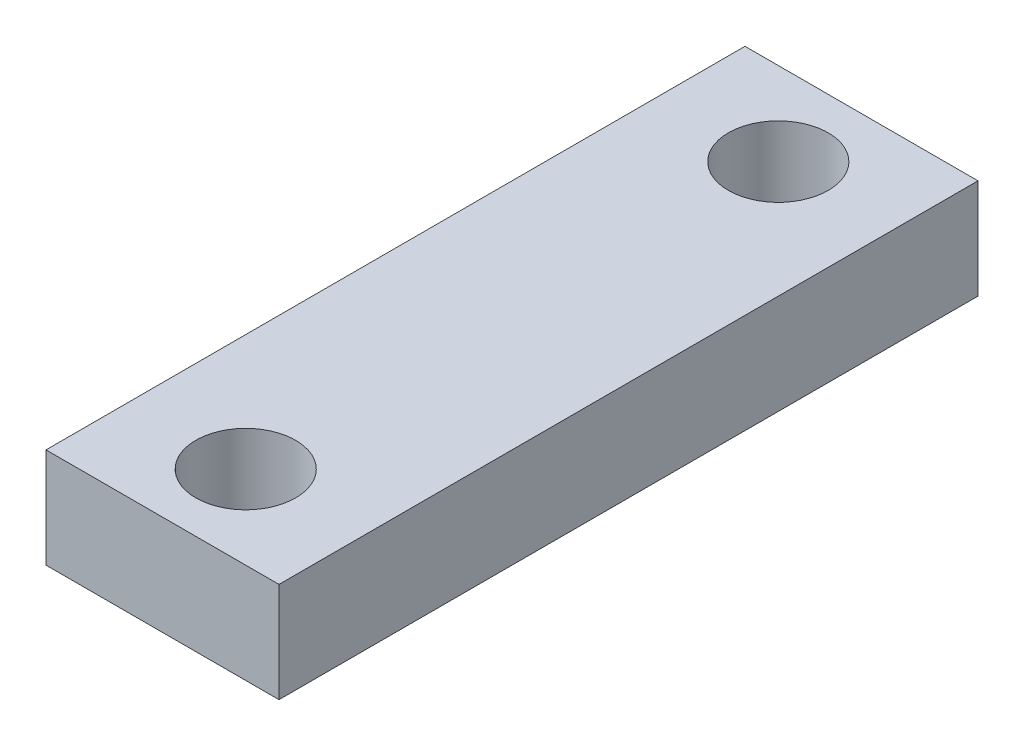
ISO-10303-21;
HEADER;
FILE_DESCRIPTION(('STEP AP214'),'2;1');
FILE_NAME('part.step','',(''),(''),'','','');
FILE_SCHEMA(('AUTOMOTIVE_DESIGN { 1 0 10303 214 1 1 1 1 }'));
ENDSEC;
DATA;
#1=APPLICATION_CONTEXT('core data for automotive mechanical design processes');
#2=APPLICATION_PROTOCOL_DEFINITION('international standard','automotive_design',2000,#1);
#3=PRODUCT_CONTEXT('',#1,'mechanical');
#4=PRODUCT('Part','Part','',(#3));
#5=PRODUCT_RELATED_PRODUCT_CATEGORY('part','',(#4));
#6=PRODUCT_DEFINITION_FORMATION('','',#4);
#7=PRODUCT_DEFINITION_CONTEXT('part definition',#1,'design');
#8=PRODUCT_DEFINITION('design','',#6,#7);
#9=PRODUCT_DEFINITION_SHAPE('','',#8);
#10=(LENGTH_UNIT() NAMED_UNIT(*) SI_UNIT(.MILLI.,.METRE.));
#11=(NAMED_UNIT(*) PLANE_ANGLE_UNIT() SI_UNIT($,.RADIAN.));
#12=(NAMED_UNIT(*) SI_UNIT($,.STERADIAN.) SOLID_ANGLE_UNIT());
#13=UNCERTAINTY_MEASURE_WITH_UNIT(LENGTH_MEASURE(1.E-05),#10,'distance_accuracy_value','');
#14=(GEOMETRIC_REPRESENTATION_CONTEXT(3) GLOBAL_UNCERTAINTY_ASSIGNED_CONTEXT((#13)) GLOBAL_UNIT_ASSIGNED_CONTEXT((#10,
#11,#12)) REPRESENTATION_CONTEXT('',''));
#15=CARTESIAN_POINT('',(0.,0.,0.));
#16=DIRECTION('',(0.,0.,1.));
#17=DIRECTION('',(1.,0.,0.));
#18=AXIS2_PLACEMENT_3D('',#15,#16,#17);
#19=CARTESIAN_POINT('',(0.,6.,0.));
#20=DIRECTION('',(0.,1.,0.));
#21=DIRECTION('',(0.,0.,1.));
#22=AXIS2_PLACEMENT_3D('',#19,#20,#21);
#23=PLANE('',#22);
#24=CARTESIAN_POINT('',(0.,6.,-16.));
#25=DIRECTION('',(0.,1.,0.));
#26=DIRECTION('',(0.,0.,1.));
#27=AXIS2_PLACEMENT_3D('',#24,#25,#26);
#28=CIRCLE('',#27,3.00000000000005);
#29=CARTESIAN_POINT('',(0.,6.,-13.));
#30=VERTEX_POINT('',#29);
#31=EDGE_CURVE('E106',#30,#30,#28,.T.);
#32=ORIENTED_EDGE('',*,*,#31,.F.);
#33=EDGE_LOOP('',(#32));
#34=FACE_BOUND('',#33,.T.);
#35=DIRECTION('',(1.,0.,0.));
#36=VECTOR('',#35,1.);
#37=CARTESIAN_POINT('',(-7.00000000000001,6.,20.9999999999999));
#38=LINE('',#37,#36);
#39=CARTESIAN_POINT('',(-7.00000000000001,6.,20.9999999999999));
#40=VERTEX_POINT('',#39);
#41=CARTESIAN_POINT('',(7.00000000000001,6.,20.9999999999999));
#42=VERTEX_POINT('',#41);
#43=EDGE_CURVE('E91',#40,#42,#38,.T.);
#44=ORIENTED_EDGE('',*,*,#43,.T.);
#45=DIRECTION('',(0.,0.,-1.));
#46=VECTOR('',#45,1.);
#47=CARTESIAN_POINT('',(7.00000000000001,6.,20.9999999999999));
#48=LINE('',#47,#46);
#49=CARTESIAN_POINT('',(7.00000000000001,6.,-20.9999999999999));
#50=VERTEX_POINT('',#49);
#51=EDGE_CURVE('E86',#42,#50,#48,.T.);
#52=ORIENTED_EDGE('',*,*,#51,.T.);
#53=DIRECTION('',(-1.,0.,0.));
#54=VECTOR('',#53,1.);
#55=CARTESIAN_POINT('',(7.00000000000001,6.,-20.9999999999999));
#56=LINE('',#55,#54);
#57=CARTESIAN_POINT('',(-7.00000000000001,6.,-20.9999999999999));
#58=VERTEX_POINT('',#57);
#59=EDGE_CURVE('E89',#50,#58,#56,.T.);
#60=ORIENTED_EDGE('',*,*,#59,.T.);
#61=DIRECTION('',(0.,0.,1.));
#62=VECTOR('',#61,1.);
#63=CARTESIAN_POINT('',(-7.00000000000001,6.,-20.9999999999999));
#64=LINE('',#63,#62);
#65=EDGE_CURVE('E56',#58,#40,#64,.T.);
#66=ORIENTED_EDGE('',*,*,#65,.T.);
#67=EDGE_LOOP('',(#44,#52,#60,#66));
#68=FACE_BOUND('',#67,.T.);
#69=CARTESIAN_POINT('',(0.,6.,16.));
#70=DIRECTION('',(0.,1.,0.));
#71=DIRECTION('',(0.,0.,1.));
#72=AXIS2_PLACEMENT_3D('',#69,#70,#71);
#73=CIRCLE('',#72,3.00000000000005);
#74=CARTESIAN_POINT('',(0.,6.,19.0000000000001));
#75=VERTEX_POINT('',#74);
#76=EDGE_CURVE('E121',#75,#75,#73,.T.);
#77=ORIENTED_EDGE('',*,*,#76,.F.);
#78=EDGE_LOOP('',(#77));
#79=FACE_BOUND('',#78,.T.);
#80=ADVANCED_FACE('F39',(#34,#68,#79),#23,.T.);
#81=CARTESIAN_POINT('',(0.,0.,0.));
#82=DIRECTION('',(0.,1.,0.));
#83=DIRECTION('',(0.,0.,1.));
#84=AXIS2_PLACEMENT_3D('',#81,#82,#83);
#85=PLANE('',#84);
#86=DIRECTION('',(1.,0.,0.));
#87=VECTOR('',#86,1.);
#88=CARTESIAN_POINT('',(-7.00000000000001,0.,20.9999999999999));
#89=LINE('',#88,#87);
#90=CARTESIAN_POINT('',(-7.00000000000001,0.,20.9999999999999));
#91=VERTEX_POINT('',#90);
#92=CARTESIAN_POINT('',(7.00000000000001,0.,20.9999999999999));
#93=VERTEX_POINT('',#92);
#94=EDGE_CURVE('E103',#91,#93,#89,.T.);
#95=ORIENTED_EDGE('',*,*,#94,.F.);
#96=DIRECTION('',(0.,0.,1.));
#97=VECTOR('',#96,1.);
#98=CARTESIAN_POINT('',(-7.00000000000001,0.,-20.9999999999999));
#99=LINE('',#98,#97);
#100=CARTESIAN_POINT('',(-7.00000000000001,0.,-20.9999999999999));
#101=VERTEX_POINT('',#100);
#102=EDGE_CURVE('E79',#101,#91,#99,.T.);
#103=ORIENTED_EDGE('',*,*,#102,.F.);
#104=DIRECTION('',(-1.,0.,0.));
#105=VECTOR('',#104,1.);
#106=CARTESIAN_POINT('',(7.00000000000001,0.,-20.9999999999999));
#107=LINE('',#106,#105);
#108=CARTESIAN_POINT('',(7.00000000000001,0.,-20.9999999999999));
#109=VERTEX_POINT('',#108);
#110=EDGE_CURVE('E73',#109,#101,#107,.T.);
#111=ORIENTED_EDGE('',*,*,#110,.F.);
#112=DIRECTION('',(0.,0.,-1.));
#113=VECTOR('',#112,1.);
#114=CARTESIAN_POINT('',(7.00000000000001,0.,20.9999999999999));
#115=LINE('',#114,#113);
#116=EDGE_CURVE('E95',#93,#109,#115,.T.);
#117=ORIENTED_EDGE('',*,*,#116,.F.);
#118=EDGE_LOOP('',(#95,#103,#111,#117));
#119=FACE_BOUND('',#118,.T.);
#120=CARTESIAN_POINT('',(0.,0.,-16.));
#121=DIRECTION('',(0.,1.,0.));
#122=DIRECTION('',(0.,0.,1.));
#123=AXIS2_PLACEMENT_3D('',#120,#121,#122);
#124=CIRCLE('',#123,3.00000000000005);
#125=CARTESIAN_POINT('',(0.,0.,-13.));
#126=VERTEX_POINT('',#125);
#127=EDGE_CURVE('E118',#126,#126,#124,.T.);
#128=ORIENTED_EDGE('',*,*,#127,.T.);
#129=EDGE_LOOP('',(#128));
#130=FACE_BOUND('',#129,.T.);
#131=CARTESIAN_POINT('',(0.,0.,16.));
#132=DIRECTION('',(0.,1.,0.));
#133=DIRECTION('',(0.,0.,1.));
#134=AXIS2_PLACEMENT_3D('',#131,#132,#133);
#135=CIRCLE('',#134,3.00000000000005);
#136=CARTESIAN_POINT('',(0.,0.,19.0000000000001));
#137=VERTEX_POINT('',#136);
#138=EDGE_CURVE('E124',#137,#137,#135,.T.);
#139=ORIENTED_EDGE('',*,*,#138,.T.);
#140=EDGE_LOOP('',(#139));
#141=FACE_BOUND('',#140,.T.);
#142=ADVANCED_FACE('F114',(#119,#130,#141),#85,.F.);
#143=CARTESIAN_POINT('',(-7.00000000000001,6.,20.9999999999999));
#144=DIRECTION('',(0.,0.,-1.));
#145=DIRECTION('',(-1.,0.,0.));
#146=AXIS2_PLACEMENT_3D('',#143,#144,#145);
#147=PLANE('',#146);
#148=ORIENTED_EDGE('',*,*,#94,.T.);
#149=DIRECTION('',(0.,-1.,0.));
#150=VECTOR('',#149,1.);
#151=CARTESIAN_POINT('',(7.00000000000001,6.,20.9999999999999));
#152=LINE('',#151,#150);
#153=EDGE_CURVE('E11',#42,#93,#152,.T.);
#154=ORIENTED_EDGE('',*,*,#153,.F.);
#155=ORIENTED_EDGE('',*,*,#43,.F.);
#156=DIRECTION('',(0.,-1.,0.));
#157=VECTOR('',#156,1.);
#158=CARTESIAN_POINT('',(-7.00000000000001,6.,20.9999999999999));
#159=LINE('',#158,#157);
#160=EDGE_CURVE('E99',#40,#91,#159,.T.);
#161=ORIENTED_EDGE('',*,*,#160,.T.);
#162=EDGE_LOOP('',(#148,#154,#155,#161));
#163=FACE_BOUND('',#162,.T.);
#164=ADVANCED_FACE('F41',(#163),#147,.F.);
#165=CARTESIAN_POINT('',(7.00000000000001,6.,20.9999999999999));
#166=DIRECTION('',(-1.,0.,0.));
#167=DIRECTION('',(0.,0.,1.));
#168=AXIS2_PLACEMENT_3D('',#165,#166,#167);
#169=PLANE('',#168);
#170=ORIENTED_EDGE('',*,*,#116,.T.);
#171=DIRECTION('',(0.,-1.,0.));
#172=VECTOR('',#171,1.);
#173=CARTESIAN_POINT('',(7.00000000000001,6.,-20.9999999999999));
#174=LINE('',#173,#172);
#175=EDGE_CURVE('E48',#50,#109,#174,.T.);
#176=ORIENTED_EDGE('',*,*,#175,.F.);
#177=ORIENTED_EDGE('',*,*,#51,.F.);
#178=ORIENTED_EDGE('',*,*,#153,.T.);
#179=EDGE_LOOP('',(#170,#176,#177,#178));
#180=FACE_BOUND('',#179,.T.);
#181=ADVANCED_FACE('F94',(#180),#169,.F.);
#182=CARTESIAN_POINT('',(7.00000000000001,6.,-20.9999999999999));
#183=DIRECTION('',(0.,0.,1.));
#184=DIRECTION('',(1.,0.,0.));
#185=AXIS2_PLACEMENT_3D('',#182,#183,#184);
#186=PLANE('',#185);
#187=ORIENTED_EDGE('',*,*,#110,.T.);
#188=DIRECTION('',(0.,-1.,0.));
#189=VECTOR('',#188,1.);
#190=CARTESIAN_POINT('',(-7.00000000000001,6.,-20.9999999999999));
#191=LINE('',#190,#189);
#192=EDGE_CURVE('E96',#58,#101,#191,.T.);
#193=ORIENTED_EDGE('',*,*,#192,.F.);
#194=ORIENTED_EDGE('',*,*,#59,.F.);
#195=ORIENTED_EDGE('',*,*,#175,.T.);
#196=EDGE_LOOP('',(#187,#193,#194,#195));
#197=FACE_BOUND('',#196,.T.);
#198=ADVANCED_FACE('F97',(#197),#186,.F.);
#199=CARTESIAN_POINT('',(-7.00000000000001,6.,-20.9999999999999));
#200=DIRECTION('',(1.,0.,0.));
#201=DIRECTION('',(0.,0.,-1.));
#202=AXIS2_PLACEMENT_3D('',#199,#200,#201);
#203=PLANE('',#202);
#204=ORIENTED_EDGE('',*,*,#102,.T.);
#205=ORIENTED_EDGE('',*,*,#160,.F.);
#206=ORIENTED_EDGE('',*,*,#65,.F.);
#207=ORIENTED_EDGE('',*,*,#192,.T.);
#208=EDGE_LOOP('',(#204,#205,#206,#207));
#209=FACE_BOUND('',#208,.T.);
#210=ADVANCED_FACE('F111',(#209),#203,.F.);
#211=CARTESIAN_POINT('',(0.,6.,-16.));
#212=DIRECTION('',(0.,-1.,0.));
#213=DIRECTION('',(0.,0.,-1.));
#214=AXIS2_PLACEMENT_3D('',#211,#212,#213);
#215=CYLINDRICAL_SURFACE('',#214,3.00000000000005);
#216=ORIENTED_EDGE('',*,*,#31,.T.);
#217=EDGE_LOOP('',(#216));
#218=FACE_BOUND('',#217,.T.);
#219=ORIENTED_EDGE('',*,*,#127,.F.);
#220=EDGE_LOOP('',(#219));
#221=FACE_BOUND('',#220,.T.);
#222=ADVANCED_FACE('F141',(#218,#221),#215,.F.);
#223=CARTESIAN_POINT('',(0.,6.,16.));
#224=DIRECTION('',(0.,-1.,0.));
#225=DIRECTION('',(0.,0.,-1.));
#226=AXIS2_PLACEMENT_3D('',#223,#224,#225);
#227=CYLINDRICAL_SURFACE('',#226,3.00000000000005);
#228=ORIENTED_EDGE('',*,*,#76,.T.);
#229=EDGE_LOOP('',(#228));
#230=FACE_BOUND('',#229,.T.);
#231=ORIENTED_EDGE('',*,*,#138,.F.);
#232=EDGE_LOOP('',(#231));
#233=FACE_BOUND('',#232,.T.);
#234=ADVANCED_FACE('F130',(#230,#233),#227,.F.);
#235=CLOSED_SHELL('',(#80,#142,#164,#181,#198,#210,#222,#234));
#236=MANIFOLD_SOLID_BREP('B2',#235);
#237=ADVANCED_BREP_SHAPE_REPRESENTATION('',(#18,#236),#14);
#238=SHAPE_DEFINITION_REPRESENTATION(#9,#237);
ENDSEC;
END-ISO-10303-21;
